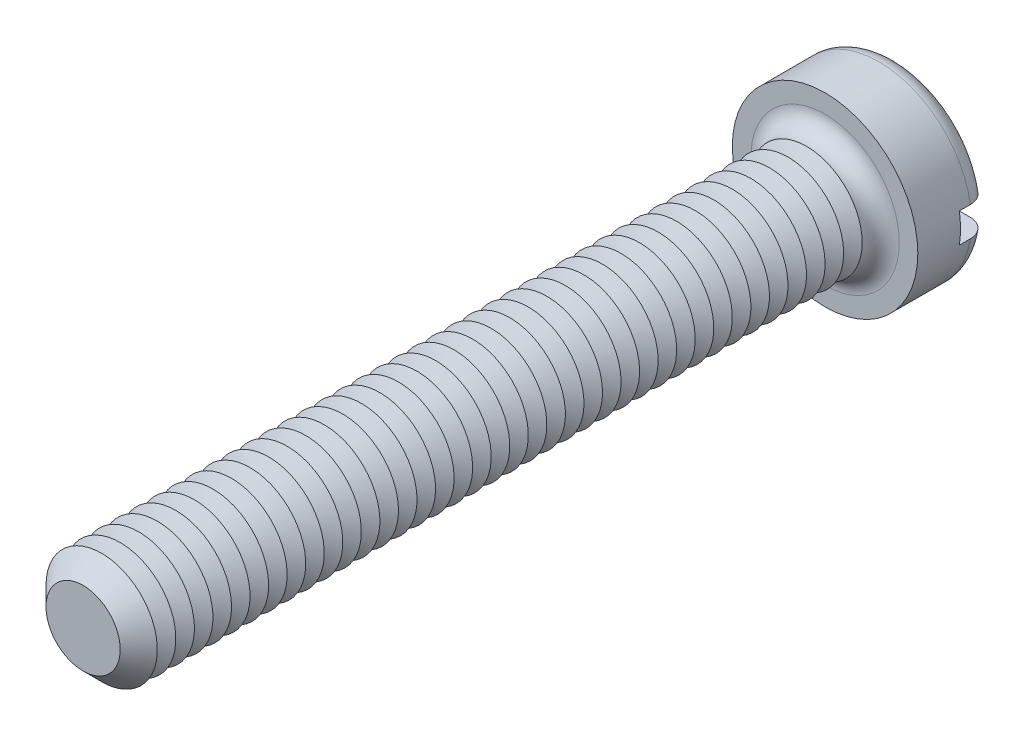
from build123d import *

# Parameters (mm, degrees)
SKETCH3_R           = 5
BOSS_EXTRUDE2_DEPTH = 3.9
SKETCH4_R           = 3
BOSS_EXTRUDE3_DEPTH = 40
FILLET1_R           = 1
CHAMFER1_SIZE       = 1
LPATTERN1_COUNT     = 38
LPATTERN1_PITCH     = 1
SKETCH8_W           = 10
SKETCH8_H           = 1.6
CUT_EXTRUDE1_DEPTH  = 1.6


with BuildPart() as part:
    # Sketch3 → Boss-Extrude2 (new body)
    with BuildSketch(Plane.XY):
        Circle(SKETCH3_R)
    extrude(amount=-BOSS_EXTRUDE2_DEPTH)

    # Sketch4 → Boss-Extrude3 (add)
    with BuildSketch(Plane.XY):
        Circle(SKETCH4_R)
    extrude(amount=BOSS_EXTRUDE3_DEPTH)

    # Fillet1
    fillet1_edges = [part.edges().sort_by_distance(p)[0] for p in [
        (-5, 0, -3.9),
        (-3, 0, 0),
    ]]
    fillet(fillet1_edges, radius=FILLET1_R)

    # Chamfer1
    chamfer1_edges = [part.edges().sort_by_distance(p)[0] for p in [
        (-3, 0, 40),
    ]]
    chamfer(chamfer1_edges, length=CHAMFER1_SIZE)

    # Sketch6 → Cut-Revolve1 (revolve, cut)
    with BuildSketch(Plane(origin=(0, 0, 0), x_dir=(0, 0, -1), z_dir=(1, 0, 0)), mode=Mode.PRIVATE) as cut_revolve1_sk:
        Polygon((-1, 3), (-1.5, 2.133974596), (-2, 3), align=None)
    cut_revolve1 = revolve(cut_revolve1_sk.sketch.rotate(Axis((0, 0, -1.694361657), (0, 0, 1)), 90), axis=Axis((0, 0, -1.694361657), (0, 0, 1)), mode=Mode.SUBTRACT)

    # LPattern1: Cut-Revolve1 ×38
    with Locations(*[(0, 0, i * LPATTERN1_PITCH) for i in range(1, LPATTERN1_COUNT)]):
        add(cut_revolve1, mode=Mode.SUBTRACT)

    # Sketch8 → Cut-Extrude1 (cut)
    with BuildSketch(Plane(origin=(0, 0, -3.9), x_dir=(-1, 0, 0), z_dir=(0, 0, -1))):
        Rectangle(SKETCH8_W, SKETCH8_H)
    extrude(amount=-CUT_EXTRUDE1_DEPTH, mode=Mode.SUBTRACT)


solid = part.part
